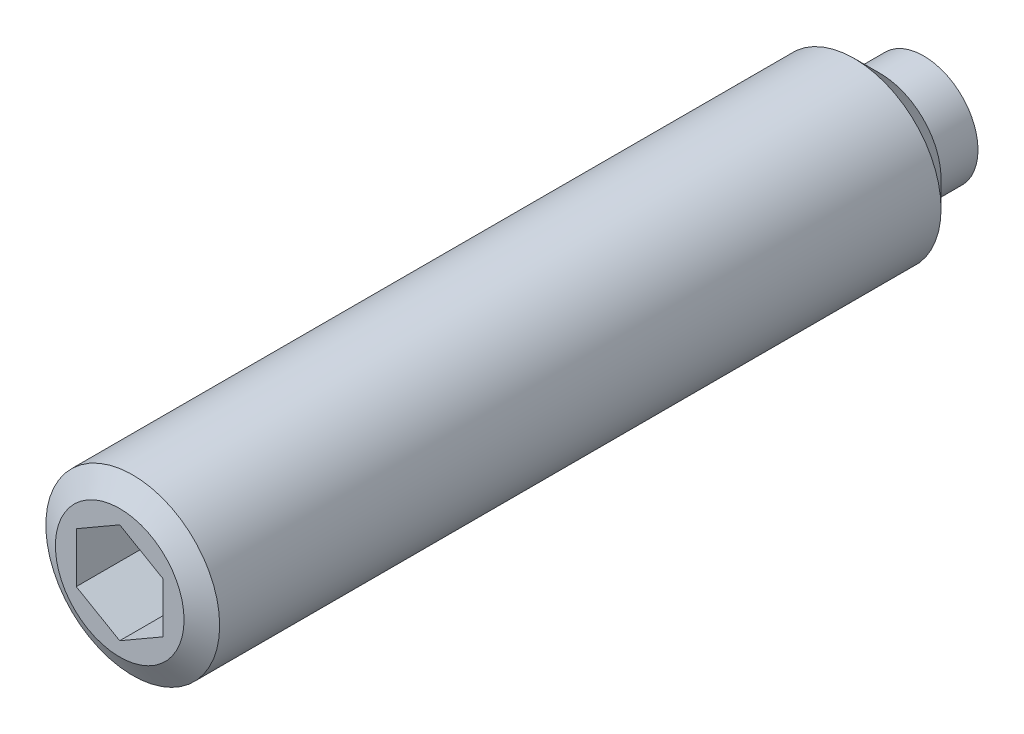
ISO-10303-21;
HEADER;
FILE_DESCRIPTION(('STEP AP214'),'2;1');
FILE_NAME('part.step','',(''),(''),'','','');
FILE_SCHEMA(('AUTOMOTIVE_DESIGN { 1 0 10303 214 1 1 1 1 }'));
ENDSEC;
DATA;
#1=APPLICATION_CONTEXT('core data for automotive mechanical design processes');
#2=APPLICATION_PROTOCOL_DEFINITION('international standard','automotive_design',2000,#1);
#3=PRODUCT_CONTEXT('',#1,'mechanical');
#4=PRODUCT('Part','Part','',(#3));
#5=PRODUCT_RELATED_PRODUCT_CATEGORY('part','',(#4));
#6=PRODUCT_DEFINITION_FORMATION('','',#4);
#7=PRODUCT_DEFINITION_CONTEXT('part definition',#1,'design');
#8=PRODUCT_DEFINITION('design','',#6,#7);
#9=PRODUCT_DEFINITION_SHAPE('','',#8);
#10=(LENGTH_UNIT() NAMED_UNIT(*) SI_UNIT(.MILLI.,.METRE.));
#11=(NAMED_UNIT(*) PLANE_ANGLE_UNIT() SI_UNIT($,.RADIAN.));
#12=(NAMED_UNIT(*) SI_UNIT($,.STERADIAN.) SOLID_ANGLE_UNIT());
#13=UNCERTAINTY_MEASURE_WITH_UNIT(LENGTH_MEASURE(1.E-05),#10,'distance_accuracy_value','');
#14=(GEOMETRIC_REPRESENTATION_CONTEXT(3) GLOBAL_UNCERTAINTY_ASSIGNED_CONTEXT((#13)) GLOBAL_UNIT_ASSIGNED_CONTEXT((#10,
#11,#12)) REPRESENTATION_CONTEXT('',''));
#15=CARTESIAN_POINT('',(0.,0.,0.));
#16=DIRECTION('',(0.,0.,1.));
#17=DIRECTION('',(1.,0.,0.));
#18=AXIS2_PLACEMENT_3D('',#15,#16,#17);
#19=CARTESIAN_POINT('',(2.5,0.,0.));
#20=DIRECTION('',(0.,0.,-1.));
#21=DIRECTION('',(-1.,0.,0.));
#22=AXIS2_PLACEMENT_3D('',#19,#20,#21);
#23=PLANE('',#22);
#24=CARTESIAN_POINT('',(0.,0.,0.));
#25=DIRECTION('',(0.,0.,1.));
#26=DIRECTION('',(1.,0.,0.));
#27=AXIS2_PLACEMENT_3D('',#24,#25,#26);
#28=CIRCLE('',#27,2.5);
#29=CARTESIAN_POINT('',(2.5,0.,0.));
#30=VERTEX_POINT('',#29);
#31=EDGE_CURVE('E124',#30,#30,#28,.T.);
#32=ORIENTED_EDGE('',*,*,#31,.F.);
#33=EDGE_LOOP('',(#32));
#34=FACE_BOUND('',#33,.T.);
#35=ADVANCED_FACE('F14',(#34),#23,.T.);
#36=CARTESIAN_POINT('',(0.,0.,57.));
#37=DIRECTION('',(0.,0.,1.));
#38=DIRECTION('',(1.,0.,0.));
#39=AXIS2_PLACEMENT_3D('',#36,#37,#38);
#40=CYLINDRICAL_SURFACE('',#39,2.5);
#41=CARTESIAN_POINT('',(0.,0.,2.));
#42=DIRECTION('',(0.,0.,1.));
#43=DIRECTION('',(1.,0.,0.));
#44=AXIS2_PLACEMENT_3D('',#41,#42,#43);
#45=CIRCLE('',#44,2.5);
#46=CARTESIAN_POINT('',(2.5,0.,2.));
#47=VERTEX_POINT('',#46);
#48=EDGE_CURVE('E121',#47,#47,#45,.T.);
#49=ORIENTED_EDGE('',*,*,#48,.F.);
#50=EDGE_LOOP('',(#49));
#51=FACE_BOUND('',#50,.T.);
#52=ORIENTED_EDGE('',*,*,#31,.T.);
#53=EDGE_LOOP('',(#52));
#54=FACE_BOUND('',#53,.T.);
#55=ADVANCED_FACE('F149',(#51,#54),#40,.T.);
#56=CARTESIAN_POINT('',(4.,0.,2.));
#57=DIRECTION('',(0.,0.,-1.));
#58=DIRECTION('',(-1.,0.,0.));
#59=AXIS2_PLACEMENT_3D('',#56,#57,#58);
#60=PLANE('',#59);
#61=CARTESIAN_POINT('',(0.,0.,2.));
#62=DIRECTION('',(0.,0.,-1.));
#63=DIRECTION('',(-1.,0.,0.));
#64=AXIS2_PLACEMENT_3D('',#61,#62,#63);
#65=CIRCLE('',#64,2.8);
#66=CARTESIAN_POINT('',(-2.8,0.,2.));
#67=VERTEX_POINT('',#66);
#68=EDGE_CURVE('E130',#67,#67,#65,.T.);
#69=ORIENTED_EDGE('',*,*,#68,.T.);
#70=EDGE_LOOP('',(#69));
#71=FACE_BOUND('',#70,.T.);
#72=ORIENTED_EDGE('',*,*,#48,.T.);
#73=EDGE_LOOP('',(#72));
#74=FACE_BOUND('',#73,.T.);
#75=ADVANCED_FACE('F155',(#71,#74),#60,.T.);
#76=CARTESIAN_POINT('',(0.,0.,57.));
#77=DIRECTION('',(0.,0.,1.));
#78=DIRECTION('',(1.,0.,0.));
#79=AXIS2_PLACEMENT_3D('',#76,#77,#78);
#80=CYLINDRICAL_SURFACE('',#79,4.);
#81=CARTESIAN_POINT('',(0.,0.,36.4));
#82=DIRECTION('',(0.,0.,1.));
#83=DIRECTION('',(1.,0.,0.));
#84=AXIS2_PLACEMENT_3D('',#81,#82,#83);
#85=CIRCLE('',#84,4.);
#86=CARTESIAN_POINT('',(4.,0.,36.4));
#87=VERTEX_POINT('',#86);
#88=EDGE_CURVE('E9',#87,#87,#85,.F.);
#89=ORIENTED_EDGE('',*,*,#88,.T.);
#90=EDGE_LOOP('',(#89));
#91=FACE_BOUND('',#90,.T.);
#92=CARTESIAN_POINT('',(0.,0.,3.2));
#93=DIRECTION('',(0.,0.,-1.));
#94=DIRECTION('',(-1.,0.,0.));
#95=AXIS2_PLACEMENT_3D('',#92,#93,#94);
#96=CIRCLE('',#95,4.);
#97=CARTESIAN_POINT('',(-4.,0.,3.2));
#98=VERTEX_POINT('',#97);
#99=EDGE_CURVE('E127',#98,#98,#96,.F.);
#100=ORIENTED_EDGE('',*,*,#99,.T.);
#101=EDGE_LOOP('',(#100));
#102=FACE_BOUND('',#101,.T.);
#103=ADVANCED_FACE('F162',(#91,#102),#80,.T.);
#104=CARTESIAN_POINT('',(0.,0.,37.));
#105=DIRECTION('',(0.,0.,1.));
#106=DIRECTION('',(1.,0.,0.));
#107=AXIS2_PLACEMENT_3D('',#104,#105,#106);
#108=PLANE('',#107);
#109=CARTESIAN_POINT('',(0.,0.,37.));
#110=DIRECTION('',(0.,0.,1.));
#111=DIRECTION('',(1.,0.,0.));
#112=AXIS2_PLACEMENT_3D('',#109,#110,#111);
#113=CIRCLE('',#112,2.96076951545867);
#114=CARTESIAN_POINT('',(2.96076951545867,0.,37.));
#115=VERTEX_POINT('',#114);
#116=EDGE_CURVE('E22',#115,#115,#113,.T.);
#117=ORIENTED_EDGE('',*,*,#116,.T.);
#118=EDGE_LOOP('',(#117));
#119=FACE_BOUND('',#118,.T.);
#120=DIRECTION('',(0.86602540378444,-0.5,0.));
#121=VECTOR('',#120,1.);
#122=CARTESIAN_POINT('',(-2.,-1.15470053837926,37.));
#123=LINE('',#122,#121);
#124=CARTESIAN_POINT('',(-2.,-1.15470053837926,37.));
#125=VERTEX_POINT('',#124);
#126=CARTESIAN_POINT('',(0.,-2.3094010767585,37.));
#127=VERTEX_POINT('',#126);
#128=EDGE_CURVE('E29',#125,#127,#123,.T.);
#129=ORIENTED_EDGE('',*,*,#128,.F.);
#130=DIRECTION('',(0.,-1.,0.));
#131=VECTOR('',#130,1.);
#132=CARTESIAN_POINT('',(-2.,1.15470053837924,37.));
#133=LINE('',#132,#131);
#134=CARTESIAN_POINT('',(-2.,1.15470053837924,37.));
#135=VERTEX_POINT('',#134);
#136=EDGE_CURVE('E97',#135,#125,#133,.T.);
#137=ORIENTED_EDGE('',*,*,#136,.F.);
#138=DIRECTION('',(0.866025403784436,0.5,0.));
#139=VECTOR('',#138,1.);
#140=CARTESIAN_POINT('',(-2.,1.15470053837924,37.));
#141=LINE('',#140,#139);
#142=CARTESIAN_POINT('',(0.,2.30940107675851,37.));
#143=VERTEX_POINT('',#142);
#144=EDGE_CURVE('E92',#135,#143,#141,.T.);
#145=ORIENTED_EDGE('',*,*,#144,.T.);
#146=DIRECTION('',(-0.866025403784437,0.5,0.));
#147=VECTOR('',#146,1.);
#148=CARTESIAN_POINT('',(2.,1.15470053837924,37.));
#149=LINE('',#148,#147);
#150=CARTESIAN_POINT('',(2.,1.15470053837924,37.));
#151=VERTEX_POINT('',#150);
#152=EDGE_CURVE('E90',#151,#143,#149,.T.);
#153=ORIENTED_EDGE('',*,*,#152,.F.);
#154=DIRECTION('',(0.,-1.,0.));
#155=VECTOR('',#154,1.);
#156=CARTESIAN_POINT('',(2.,1.15470053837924,37.));
#157=LINE('',#156,#155);
#158=CARTESIAN_POINT('',(2.,-1.15470053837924,37.));
#159=VERTEX_POINT('',#158);
#160=EDGE_CURVE('E72',#151,#159,#157,.T.);
#161=ORIENTED_EDGE('',*,*,#160,.T.);
#162=DIRECTION('',(-0.866025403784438,-0.5,0.));
#163=VECTOR('',#162,1.);
#164=CARTESIAN_POINT('',(2.,-1.15470053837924,37.));
#165=LINE('',#164,#163);
#166=EDGE_CURVE('E83',#159,#127,#165,.T.);
#167=ORIENTED_EDGE('',*,*,#166,.T.);
#168=EDGE_LOOP('',(#129,#137,#145,#153,#161,#167));
#169=FACE_BOUND('',#168,.T.);
#170=ADVANCED_FACE('F87',(#119,#169),#108,.T.);
#171=CARTESIAN_POINT('',(-2.,-1.15470053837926,33.));
#172=DIRECTION('',(-0.5,-0.86602540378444,0.));
#173=DIRECTION('',(-0.86602540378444,0.5,0.));
#174=AXIS2_PLACEMENT_3D('',#171,#172,#173);
#175=PLANE('',#174);
#176=DIRECTION('',(0.,0.,1.));
#177=VECTOR('',#176,1.);
#178=CARTESIAN_POINT('',(-2.,-1.15470053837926,33.));
#179=LINE('',#178,#177);
#180=CARTESIAN_POINT('',(-2.,-1.15470053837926,33.));
#181=VERTEX_POINT('',#180);
#182=EDGE_CURVE('E36',#181,#125,#179,.T.);
#183=ORIENTED_EDGE('',*,*,#182,.T.);
#184=ORIENTED_EDGE('',*,*,#128,.T.);
#185=DIRECTION('',(0.,0.,1.));
#186=VECTOR('',#185,1.);
#187=CARTESIAN_POINT('',(0.,-2.3094010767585,33.));
#188=LINE('',#187,#186);
#189=CARTESIAN_POINT('',(0.,-2.3094010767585,33.));
#190=VERTEX_POINT('',#189);
#191=EDGE_CURVE('E80',#190,#127,#188,.T.);
#192=ORIENTED_EDGE('',*,*,#191,.F.);
#193=DIRECTION('',(0.86602540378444,-0.5,0.));
#194=VECTOR('',#193,1.);
#195=CARTESIAN_POINT('',(-2.,-1.15470053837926,33.));
#196=LINE('',#195,#194);
#197=EDGE_CURVE('E99',#181,#190,#196,.T.);
#198=ORIENTED_EDGE('',*,*,#197,.F.);
#199=EDGE_LOOP('',(#183,#184,#192,#198));
#200=FACE_BOUND('',#199,.T.);
#201=ADVANCED_FACE('F169',(#200),#175,.F.);
#202=CARTESIAN_POINT('',(-2.,1.15470053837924,33.));
#203=DIRECTION('',(-1.,0.,0.));
#204=DIRECTION('',(0.,1.,0.));
#205=AXIS2_PLACEMENT_3D('',#202,#203,#204);
#206=PLANE('',#205);
#207=DIRECTION('',(0.,0.,1.));
#208=VECTOR('',#207,1.);
#209=CARTESIAN_POINT('',(-2.,1.15470053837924,33.));
#210=LINE('',#209,#208);
#211=CARTESIAN_POINT('',(-2.,1.15470053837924,33.));
#212=VERTEX_POINT('',#211);
#213=EDGE_CURVE('E118',#212,#135,#210,.T.);
#214=ORIENTED_EDGE('',*,*,#213,.T.);
#215=ORIENTED_EDGE('',*,*,#136,.T.);
#216=ORIENTED_EDGE('',*,*,#182,.F.);
#217=DIRECTION('',(0.,-1.,0.));
#218=VECTOR('',#217,1.);
#219=CARTESIAN_POINT('',(-2.,1.15470053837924,33.));
#220=LINE('',#219,#218);
#221=EDGE_CURVE('E111',#212,#181,#220,.T.);
#222=ORIENTED_EDGE('',*,*,#221,.F.);
#223=EDGE_LOOP('',(#214,#215,#216,#222));
#224=FACE_BOUND('',#223,.T.);
#225=ADVANCED_FACE('F170',(#224),#206,.F.);
#226=CARTESIAN_POINT('',(-2.,1.15470053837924,33.));
#227=DIRECTION('',(0.5,-0.866025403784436,0.));
#228=DIRECTION('',(-0.866025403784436,-0.5,0.));
#229=AXIS2_PLACEMENT_3D('',#226,#227,#228);
#230=PLANE('',#229);
#231=DIRECTION('',(0.,0.,1.));
#232=VECTOR('',#231,1.);
#233=CARTESIAN_POINT('',(0.,2.30940107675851,33.));
#234=LINE('',#233,#232);
#235=CARTESIAN_POINT('',(0.,2.30940107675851,33.));
#236=VERTEX_POINT('',#235);
#237=EDGE_CURVE('E116',#236,#143,#234,.T.);
#238=ORIENTED_EDGE('',*,*,#237,.T.);
#239=ORIENTED_EDGE('',*,*,#144,.F.);
#240=ORIENTED_EDGE('',*,*,#213,.F.);
#241=DIRECTION('',(0.866025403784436,0.5,0.));
#242=VECTOR('',#241,1.);
#243=CARTESIAN_POINT('',(-2.,1.15470053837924,33.));
#244=LINE('',#243,#242);
#245=EDGE_CURVE('E108',#212,#236,#244,.T.);
#246=ORIENTED_EDGE('',*,*,#245,.T.);
#247=EDGE_LOOP('',(#238,#239,#240,#246));
#248=FACE_BOUND('',#247,.T.);
#249=ADVANCED_FACE('F173',(#248),#230,.T.);
#250=CARTESIAN_POINT('',(2.,1.15470053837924,33.));
#251=DIRECTION('',(0.5,0.866025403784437,0.));
#252=DIRECTION('',(0.866025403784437,-0.5,0.));
#253=AXIS2_PLACEMENT_3D('',#250,#251,#252);
#254=PLANE('',#253);
#255=DIRECTION('',(0.,0.,1.));
#256=VECTOR('',#255,1.);
#257=CARTESIAN_POINT('',(2.,1.15470053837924,33.));
#258=LINE('',#257,#256);
#259=CARTESIAN_POINT('',(2.,1.15470053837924,33.));
#260=VERTEX_POINT('',#259);
#261=EDGE_CURVE('E79',#260,#151,#258,.T.);
#262=ORIENTED_EDGE('',*,*,#261,.T.);
#263=ORIENTED_EDGE('',*,*,#152,.T.);
#264=ORIENTED_EDGE('',*,*,#237,.F.);
#265=DIRECTION('',(-0.866025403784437,0.5,0.));
#266=VECTOR('',#265,1.);
#267=CARTESIAN_POINT('',(2.,1.15470053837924,33.));
#268=LINE('',#267,#266);
#269=EDGE_CURVE('E105',#260,#236,#268,.T.);
#270=ORIENTED_EDGE('',*,*,#269,.F.);
#271=EDGE_LOOP('',(#262,#263,#264,#270));
#272=FACE_BOUND('',#271,.T.);
#273=ADVANCED_FACE('F176',(#272),#254,.F.);
#274=CARTESIAN_POINT('',(2.,1.15470053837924,33.));
#275=DIRECTION('',(-1.,0.,0.));
#276=DIRECTION('',(0.,0.,1.));
#277=AXIS2_PLACEMENT_3D('',#274,#275,#276);
#278=PLANE('',#277);
#279=DIRECTION('',(0.,0.,1.));
#280=VECTOR('',#279,1.);
#281=CARTESIAN_POINT('',(2.,-1.15470053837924,33.));
#282=LINE('',#281,#280);
#283=CARTESIAN_POINT('',(2.,-1.15470053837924,33.));
#284=VERTEX_POINT('',#283);
#285=EDGE_CURVE('E68',#284,#159,#282,.T.);
#286=ORIENTED_EDGE('',*,*,#285,.T.);
#287=ORIENTED_EDGE('',*,*,#160,.F.);
#288=ORIENTED_EDGE('',*,*,#261,.F.);
#289=DIRECTION('',(0.,-1.,0.));
#290=VECTOR('',#289,1.);
#291=CARTESIAN_POINT('',(2.,1.15470053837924,33.));
#292=LINE('',#291,#290);
#293=EDGE_CURVE('E75',#260,#284,#292,.T.);
#294=ORIENTED_EDGE('',*,*,#293,.T.);
#295=EDGE_LOOP('',(#286,#287,#288,#294));
#296=FACE_BOUND('',#295,.T.);
#297=ADVANCED_FACE('F70',(#296),#278,.T.);
#298=CARTESIAN_POINT('',(2.,-1.15470053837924,33.));
#299=DIRECTION('',(-0.5,0.866025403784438,0.));
#300=DIRECTION('',(0.866025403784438,0.5,0.));
#301=AXIS2_PLACEMENT_3D('',#298,#299,#300);
#302=PLANE('',#301);
#303=DIRECTION('',(-0.866025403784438,-0.5,0.));
#304=VECTOR('',#303,1.);
#305=CARTESIAN_POINT('',(2.,-1.15470053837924,33.));
#306=LINE('',#305,#304);
#307=EDGE_CURVE('E102',#284,#190,#306,.T.);
#308=ORIENTED_EDGE('',*,*,#307,.T.);
#309=ORIENTED_EDGE('',*,*,#191,.T.);
#310=ORIENTED_EDGE('',*,*,#166,.F.);
#311=ORIENTED_EDGE('',*,*,#285,.F.);
#312=EDGE_LOOP('',(#308,#309,#310,#311));
#313=FACE_BOUND('',#312,.T.);
#314=ADVANCED_FACE('F84',(#313),#302,.T.);
#315=CARTESIAN_POINT('',(-4.,0.,33.));
#316=DIRECTION('',(0.,0.,1.));
#317=DIRECTION('',(1.,0.,0.));
#318=AXIS2_PLACEMENT_3D('',#315,#316,#317);
#319=PLANE('',#318);
#320=ORIENTED_EDGE('',*,*,#197,.T.);
#321=ORIENTED_EDGE('',*,*,#307,.F.);
#322=ORIENTED_EDGE('',*,*,#293,.F.);
#323=ORIENTED_EDGE('',*,*,#269,.T.);
#324=ORIENTED_EDGE('',*,*,#245,.F.);
#325=ORIENTED_EDGE('',*,*,#221,.T.);
#326=EDGE_LOOP('',(#320,#321,#322,#323,#324,#325));
#327=FACE_BOUND('',#326,.T.);
#328=ADVANCED_FACE('F144',(#327),#319,.T.);
#329=CARTESIAN_POINT('',(0.,0.,3.2));
#330=DIRECTION('',(0.,0.,1.));
#331=DIRECTION('',(1.,0.,0.));
#332=AXIS2_PLACEMENT_3D('',#329,#330,#331);
#333=CONICAL_SURFACE('',#332,4.,0.785398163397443);
#334=ORIENTED_EDGE('',*,*,#68,.F.);
#335=EDGE_LOOP('',(#334));
#336=FACE_BOUND('',#335,.T.);
#337=ORIENTED_EDGE('',*,*,#99,.F.);
#338=EDGE_LOOP('',(#337));
#339=FACE_BOUND('',#338,.T.);
#340=ADVANCED_FACE('F137',(#336,#339),#333,.T.);
#341=CARTESIAN_POINT('',(0.,0.,37.));
#342=DIRECTION('',(0.,0.,-1.));
#343=DIRECTION('',(-1.,0.,0.));
#344=AXIS2_PLACEMENT_3D('',#341,#342,#343);
#345=CONICAL_SURFACE('',#344,2.96076951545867,1.0471975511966);
#346=ORIENTED_EDGE('',*,*,#88,.F.);
#347=EDGE_LOOP('',(#346));
#348=FACE_BOUND('',#347,.T.);
#349=ORIENTED_EDGE('',*,*,#116,.F.);
#350=EDGE_LOOP('',(#349));
#351=FACE_BOUND('',#350,.T.);
#352=ADVANCED_FACE('F16',(#348,#351),#345,.T.);
#353=CLOSED_SHELL('',(#35,#55,#75,#103,#170,#201,#225,#249,#273,#297,#314,#328,#340,#352));
#354=MANIFOLD_SOLID_BREP('B1',#353);
#355=ADVANCED_BREP_SHAPE_REPRESENTATION('',(#18,#354),#14);
#356=SHAPE_DEFINITION_REPRESENTATION(#9,#355);
ENDSEC;
END-ISO-10303-21;
